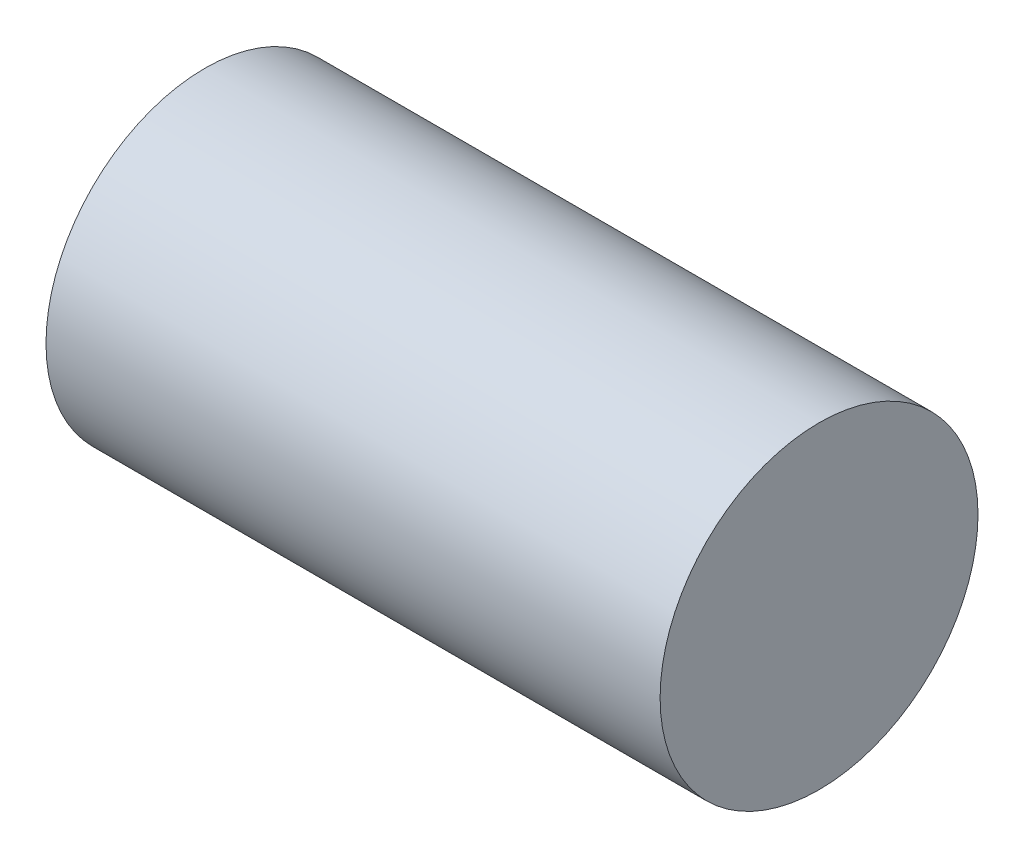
from build123d import *

# Parameters (mm, degrees)
ESQUISSE1_R      = 11
EXTRUSION1_DEPTH = 42.5


with BuildPart() as part:
    # Esquisse1 → Extrusion1 (new body)
    with BuildSketch(Plane(origin=(0, 0, 0), x_dir=(0, 0, -1), z_dir=(1, 0, 0))):
        Circle(ESQUISSE1_R)
    extrude(amount=EXTRUSION1_DEPTH)


solid = part.part
